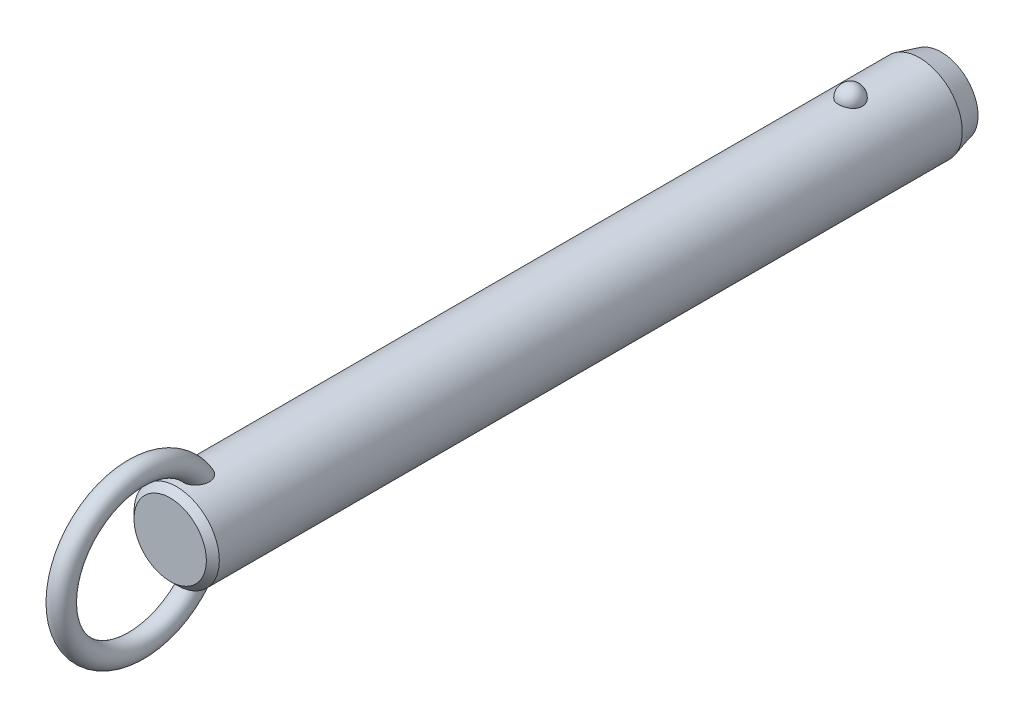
ISO-10303-21;
HEADER;
FILE_DESCRIPTION(('STEP AP214'),'2;1');
FILE_NAME('part.step','',(''),(''),'','','');
FILE_SCHEMA(('AUTOMOTIVE_DESIGN { 1 0 10303 214 1 1 1 1 }'));
ENDSEC;
DATA;
#1=APPLICATION_CONTEXT('core data for automotive mechanical design processes');
#2=APPLICATION_PROTOCOL_DEFINITION('international standard','automotive_design',2000,#1);
#3=PRODUCT_CONTEXT('',#1,'mechanical');
#4=PRODUCT('Part','Part','',(#3));
#5=PRODUCT_RELATED_PRODUCT_CATEGORY('part','',(#4));
#6=PRODUCT_DEFINITION_FORMATION('','',#4);
#7=PRODUCT_DEFINITION_CONTEXT('part definition',#1,'design');
#8=PRODUCT_DEFINITION('design','',#6,#7);
#9=PRODUCT_DEFINITION_SHAPE('','',#8);
#10=(LENGTH_UNIT() NAMED_UNIT(*) SI_UNIT(.MILLI.,.METRE.));
#11=(NAMED_UNIT(*) PLANE_ANGLE_UNIT() SI_UNIT($,.RADIAN.));
#12=(NAMED_UNIT(*) SI_UNIT($,.STERADIAN.) SOLID_ANGLE_UNIT());
#13=UNCERTAINTY_MEASURE_WITH_UNIT(LENGTH_MEASURE(1.E-05),#10,'distance_accuracy_value','');
#14=(GEOMETRIC_REPRESENTATION_CONTEXT(3) GLOBAL_UNCERTAINTY_ASSIGNED_CONTEXT((#13)) GLOBAL_UNIT_ASSIGNED_CONTEXT((#10,
#11,#12)) REPRESENTATION_CONTEXT('',''));
#15=CARTESIAN_POINT('',(0.,0.,0.));
#16=DIRECTION('',(0.,0.,1.));
#17=DIRECTION('',(1.,0.,0.));
#18=AXIS2_PLACEMENT_3D('',#15,#16,#17);
#19=CARTESIAN_POINT('',(0.,0.,114.3));
#20=DIRECTION('',(0.,0.,-1.));
#21=DIRECTION('',(-1.,0.,0.));
#22=AXIS2_PLACEMENT_3D('',#19,#20,#21);
#23=CYLINDRICAL_SURFACE('',#22,7.9);
#24=CARTESIAN_POINT('',(2.1785689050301,7.59367088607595,-2.19999999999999));
#25=CARTESIAN_POINT('',(2.17856679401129,7.59367269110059,-2.07701843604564));
#26=CARTESIAN_POINT('',(2.16853481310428,7.59657145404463,-1.95401006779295));
#27=CARTESIAN_POINT('',(2.12864689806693,7.607843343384,-1.71147811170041));
#28=CARTESIAN_POINT('',(2.09878338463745,7.61621856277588,-1.59195587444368));
#29=CARTESIAN_POINT('',(2.0199931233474,7.63749180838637,-1.3598563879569));
#30=CARTESIAN_POINT('',(1.97107475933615,7.6503878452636,-1.24727610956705));
#31=CARTESIAN_POINT('',(1.85539377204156,7.67926115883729,-1.03213234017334));
#32=CARTESIAN_POINT('',(1.78863158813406,7.69523835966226,-0.929568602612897));
#33=CARTESIAN_POINT('',(1.63856494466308,7.7285848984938,-0.736786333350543));
#34=CARTESIAN_POINT('',(1.55518140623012,7.7459606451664,-0.646630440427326));
#35=CARTESIAN_POINT('',(1.37422937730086,7.78009978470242,-0.481747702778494));
#36=CARTESIAN_POINT('',(1.27666086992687,7.79686317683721,-0.407020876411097));
#37=CARTESIAN_POINT('',(1.07024728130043,7.82786153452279,-0.275278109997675));
#38=CARTESIAN_POINT('',(0.961434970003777,7.84210353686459,-0.218212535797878));
#39=CARTESIAN_POINT('',(0.735351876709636,7.86652194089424,-0.123146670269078));
#40=CARTESIAN_POINT('',(0.618082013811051,7.87669878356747,-0.085144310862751));
#41=CARTESIAN_POINT('',(0.380637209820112,7.89170521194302,-0.0298158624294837));
#42=CARTESIAN_POINT('',(0.260550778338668,7.89662650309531,-0.0121347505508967));
#43=CARTESIAN_POINT('',(0.0190117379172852,7.90090003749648,0.00324379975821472));
#44=CARTESIAN_POINT('',(-0.102440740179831,7.90025280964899,0.00094313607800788));
#45=CARTESIAN_POINT('',(-0.341452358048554,7.89351056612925,-0.0233955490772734));
#46=CARTESIAN_POINT('',(-0.459042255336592,7.88749257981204,-0.0451545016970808));
#47=CARTESIAN_POINT('',(-0.688796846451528,7.87075812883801,-0.107408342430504));
#48=CARTESIAN_POINT('',(-0.800961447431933,7.86004158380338,-0.147903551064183));
#49=CARTESIAN_POINT('',(-1.01743634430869,7.83497131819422,-0.246799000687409));
#50=CARTESIAN_POINT('',(-1.12169791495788,7.82059709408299,-0.305300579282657));
#51=CARTESIAN_POINT('',(-1.31891765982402,7.78976470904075,-0.438549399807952));
#52=CARTESIAN_POINT('',(-1.41187469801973,7.77330633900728,-0.513298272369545));
#53=CARTESIAN_POINT('',(-1.58577142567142,7.73972434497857,-0.678622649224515));
#54=CARTESIAN_POINT('',(-1.66645140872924,7.72259402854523,-0.769470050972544));
#55=CARTESIAN_POINT('',(-1.81161503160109,7.68983776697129,-0.963538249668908));
#56=CARTESIAN_POINT('',(-1.87609753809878,7.6742119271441,-1.06675991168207));
#57=CARTESIAN_POINT('',(-1.98790138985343,7.6460202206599,-1.28401170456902));
#58=CARTESIAN_POINT('',(-2.03501994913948,7.63349104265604,-1.39815107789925));
#59=CARTESIAN_POINT('',(-2.10986724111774,7.6131449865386,-1.63301784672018));
#60=CARTESIAN_POINT('',(-2.1375965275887,7.60532797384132,-1.75374505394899));
#61=CARTESIAN_POINT('',(-2.17289256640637,7.5953195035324,-1.99782562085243));
#62=CARTESIAN_POINT('',(-2.18054294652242,7.59310471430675,-2.12116592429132));
#63=CARTESIAN_POINT('',(-2.17572919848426,7.59448538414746,-2.36741799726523));
#64=CARTESIAN_POINT('',(-2.1632656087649,7.59808068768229,-2.49032977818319));
#65=CARTESIAN_POINT('',(-2.11865035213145,7.61064035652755,-2.73161015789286));
#66=CARTESIAN_POINT('',(-2.08659579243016,7.61957823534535,-2.84999812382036));
#67=CARTESIAN_POINT('',(-2.00367799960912,7.64179982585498,-3.07955956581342));
#68=CARTESIAN_POINT('',(-1.9528140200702,7.65508371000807,-3.19073275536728));
#69=CARTESIAN_POINT('',(-1.83321113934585,7.68460381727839,-3.40337899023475));
#70=CARTESIAN_POINT('',(-1.76437735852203,7.70085556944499,-3.50479651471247));
#71=CARTESIAN_POINT('',(-1.61069526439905,7.73445734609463,-3.69446912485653));
#72=CARTESIAN_POINT('',(-1.52584634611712,7.75180741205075,-3.78272371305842));
#73=CARTESIAN_POINT('',(-1.34198059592,7.78574608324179,-3.94393987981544));
#74=CARTESIAN_POINT('',(-1.24291308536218,7.80233167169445,-4.01684434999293));
#75=CARTESIAN_POINT('',(-1.03352039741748,7.83281625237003,-4.14489386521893));
#76=CARTESIAN_POINT('',(-0.92319600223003,7.84671543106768,-4.20004014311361));
#77=CARTESIAN_POINT('',(-0.695822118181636,7.87011575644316,-4.29042017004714));
#78=CARTESIAN_POINT('',(-0.578872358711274,7.87966903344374,-4.32589112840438));
#79=CARTESIAN_POINT('',(-0.340410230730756,7.8935652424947,-4.37692226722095));
#80=CARTESIAN_POINT('',(-0.218898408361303,7.89790879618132,-4.39248482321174));
#81=CARTESIAN_POINT('',(0.0228107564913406,7.90087453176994,-4.40314405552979));
#82=CARTESIAN_POINT('',(0.142990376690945,7.89960185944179,-4.39861683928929));
#83=CARTESIAN_POINT('',(0.380829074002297,7.89171262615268,-4.37008293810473));
#84=CARTESIAN_POINT('',(0.498488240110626,7.8850962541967,-4.34607694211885));
#85=CARTESIAN_POINT('',(0.727535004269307,7.86726442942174,-4.27939317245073));
#86=CARTESIAN_POINT('',(0.838944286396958,7.85606616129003,-4.236785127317));
#87=CARTESIAN_POINT('',(1.05295421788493,7.83025654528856,-4.13408348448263));
#88=CARTESIAN_POINT('',(1.15555431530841,7.81564498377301,-4.07398879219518));
#89=CARTESIAN_POINT('',(1.35076763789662,7.7843022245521,-3.93687432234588));
#90=CARTESIAN_POINT('',(1.4432046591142,7.76754209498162,-3.85961036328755));
#91=CARTESIAN_POINT('',(1.6139111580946,7.73387857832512,-3.69076949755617));
#92=CARTESIAN_POINT('',(1.6921781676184,7.71697516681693,-3.59919010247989));
#93=CARTESIAN_POINT('',(1.83380875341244,7.6845643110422,-3.40247278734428));
#94=CARTESIAN_POINT('',(1.89689280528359,7.66908588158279,-3.29712873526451));
#95=CARTESIAN_POINT('',(2.0047823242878,7.64159441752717,-3.07707931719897));
#96=CARTESIAN_POINT('',(2.0495945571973,7.62958010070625,-2.96237743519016));
#97=CARTESIAN_POINT('',(2.11580183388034,7.61146617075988,-2.74040519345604));
#98=CARTESIAN_POINT('',(2.13929812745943,7.60484503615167,-2.63379846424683));
#99=CARTESIAN_POINT('',(2.17068242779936,7.59594664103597,-2.41813481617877));
#100=CARTESIAN_POINT('',(2.17857077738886,7.59366928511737,-2.30907795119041));
#101=CARTESIAN_POINT('',(2.1785689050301,7.59367088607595,-2.19999999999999));
#102=B_SPLINE_CURVE_WITH_KNOTS('',3,(#24,#25,#26,#27,#28,#29,#30,#31,#32,#33,#34,#35,#36,#37,
#38,#39,#40,#41,#42,#43,#44,#45,#46,#47,#48,#49,#50,#51,#52,#53,#54,#55,#56,#57,#58,#59,#60,#61,
#62,#63,#64,#65,#66,#67,#68,#69,#70,#71,#72,#73,#74,#75,#76,#77,#78,#79,#80,#81,#82,#83,#84,#85,
#86,#87,#88,#89,#90,#91,#92,#93,#94,#95,#96,#97,#98,#99,#100,#101),.UNSPECIFIED.,.T.,.F.,(4,2,2,
2,2,2,2,2,2,2,2,2,2,2,2,2,2,2,2,2,2,2,2,2,2,2,2,2,2,2,2,2,2,2,2,2,2,2,4),(0.,0.368552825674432,
0.737246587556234,1.10577831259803,1.4743009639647,1.8446206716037,2.21494081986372,
2.5842105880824,2.95344028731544,3.31611630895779,3.67875788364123,4.03628044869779,
4.39380913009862,4.75338791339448,5.11300280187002,5.47939989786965,5.8458226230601,
6.21639834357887,6.58696347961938,6.95598276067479,7.32499216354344,7.69218715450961,
8.0593967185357,8.42858578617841,8.79778880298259,9.16834203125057,9.5388695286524,
9.90482699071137,10.2707407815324,10.6298333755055,10.9889132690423,11.3466585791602,
11.7044262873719,12.0676511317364,12.4309391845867,12.8004764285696,13.1698767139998,
13.4967701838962,13.8236564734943),.UNSPECIFIED.);
#103=CARTESIAN_POINT('',(2.1785689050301,7.59367088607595,-2.19999999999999));
#104=VERTEX_POINT('',#103);
#105=EDGE_CURVE('E41',#104,#104,#102,.T.);
#106=ORIENTED_EDGE('',*,*,#105,.T.);
#107=EDGE_LOOP('',(#106));
#108=FACE_BOUND('',#107,.T.);
#109=CARTESIAN_POINT('',(0.,0.,122.62));
#110=DIRECTION('',(0.,0.,1.));
#111=DIRECTION('',(1.,0.,0.));
#112=AXIS2_PLACEMENT_3D('',#109,#110,#111);
#113=CIRCLE('',#112,7.9);
#114=CARTESIAN_POINT('',(7.9,0.,122.62));
#115=VERTEX_POINT('',#114);
#116=EDGE_CURVE('E10',#115,#115,#113,.F.);
#117=ORIENTED_EDGE('',*,*,#116,.T.);
#118=EDGE_LOOP('',(#117));
#119=FACE_BOUND('',#118,.T.);
#120=CARTESIAN_POINT('',(-0.630969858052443,-7.87476203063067,116.512432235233));
#121=CARTESIAN_POINT('',(-0.734180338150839,-7.8664899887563,116.547285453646));
#122=CARTESIAN_POINT('',(-0.834476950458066,-7.85639291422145,116.590816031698));
#123=CARTESIAN_POINT('',(-1.0262035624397,-7.83366343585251,116.694094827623));
#124=CARTESIAN_POINT('',(-1.1176141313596,-7.82102565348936,116.753877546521));
#125=CARTESIAN_POINT('',(-1.28877277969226,-7.79464922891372,116.887839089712));
#126=CARTESIAN_POINT('',(-1.36854014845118,-7.78091246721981,116.961993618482));
#127=CARTESIAN_POINT('',(-1.5146152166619,-7.75380398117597,117.122494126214));
#128=CARTESIAN_POINT('',(-1.58092966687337,-7.74043207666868,117.208833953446));
#129=CARTESIAN_POINT('',(-1.70019064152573,-7.71512522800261,117.392978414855));
#130=CARTESIAN_POINT('',(-1.75284037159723,-7.70322473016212,117.490979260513));
#131=CARTESIAN_POINT('',(-1.84263464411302,-7.68224112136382,117.694102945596));
#132=CARTESIAN_POINT('',(-1.87977299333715,-7.6731591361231,117.799228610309));
#133=CARTESIAN_POINT('',(-1.94152728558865,-7.65777930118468,118.023284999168));
#134=CARTESIAN_POINT('',(-1.96475471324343,-7.65179654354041,118.142616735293));
#135=CARTESIAN_POINT('',(-1.99449499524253,-7.64409642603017,118.38342986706));
#136=CARTESIAN_POINT('',(-2.0010005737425,-7.64238092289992,118.504912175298));
#137=CARTESIAN_POINT('',(-1.99856014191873,-7.64302120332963,118.768340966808));
#138=CARTESIAN_POINT('',(-1.98680021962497,-7.64611845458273,118.91025654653));
#139=CARTESIAN_POINT('',(-1.9445777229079,-7.65696186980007,119.191118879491));
#140=CARTESIAN_POINT('',(-1.91409393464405,-7.66471330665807,119.330062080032));
#141=CARTESIAN_POINT('',(-1.82768670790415,-7.68582947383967,119.631939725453));
#142=CARTESIAN_POINT('',(-1.76772963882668,-7.70003779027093,119.793686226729));
#143=CARTESIAN_POINT('',(-1.65998501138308,-7.72371550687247,120.027695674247));
#144=CARTESIAN_POINT('',(-1.62107967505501,-7.73200670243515,120.104297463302));
#145=CARTESIAN_POINT('',(-1.53727726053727,-7.74910377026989,120.254079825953));
#146=CARTESIAN_POINT('',(-1.49238215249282,-7.75790947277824,120.327261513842));
#147=CARTESIAN_POINT('',(-1.3739705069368,-7.77993338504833,120.50288382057));
#148=CARTESIAN_POINT('',(-1.29690364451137,-7.79328473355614,120.602955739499));
#149=CARTESIAN_POINT('',(-1.1288548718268,-7.81939266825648,120.790714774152));
#150=CARTESIAN_POINT('',(-1.03789926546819,-7.83215032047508,120.878424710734));
#151=CARTESIAN_POINT('',(-0.869532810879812,-7.85231710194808,121.013414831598));
#152=CARTESIAN_POINT('',(-0.795716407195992,-7.86021093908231,121.065076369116));
#153=CARTESIAN_POINT('',(-0.64081313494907,-7.87434920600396,121.156381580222));
#154=CARTESIAN_POINT('',(-0.559737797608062,-7.88059619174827,121.19604389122));
#155=CARTESIAN_POINT('',(-0.406456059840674,-7.88984116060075,121.254300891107));
#156=CARTESIAN_POINT('',(-0.335227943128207,-7.89321892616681,121.275384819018));
#157=CARTESIAN_POINT('',(-0.190193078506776,-7.89804235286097,121.30541418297));
#158=CARTESIAN_POINT('',(-0.116388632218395,-7.89948969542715,121.314370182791));
#159=CARTESIAN_POINT('',(0.031841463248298,-7.90028409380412,121.319291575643));
#160=CARTESIAN_POINT('',(0.106268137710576,-7.89962640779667,121.315227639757));
#161=CARTESIAN_POINT('',(0.253290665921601,-7.8962818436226,121.294461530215));
#162=CARTESIAN_POINT('',(0.325885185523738,-7.8935935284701,121.277750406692));
#163=CARTESIAN_POINT('',(0.4814417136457,-7.88577340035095,121.228738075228));
#164=CARTESIAN_POINT('',(0.563611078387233,-7.88026321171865,121.194005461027));
#165=CARTESIAN_POINT('',(0.721129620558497,-7.86741729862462,121.111796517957));
#166=CARTESIAN_POINT('',(0.79646633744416,-7.86007832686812,121.064297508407));
#167=CARTESIAN_POINT('',(0.971456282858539,-7.84073285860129,120.936513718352));
#168=CARTESIAN_POINT('',(1.06719686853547,-7.82809461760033,120.851004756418));
#169=CARTESIAN_POINT('',(1.24418921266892,-7.80192439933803,120.666232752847));
#170=CARTESIAN_POINT('',(1.32540832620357,-7.78839049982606,120.566939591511));
#171=CARTESIAN_POINT('',(1.45199971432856,-7.76559693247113,120.389576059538));
#172=CARTESIAN_POINT('',(1.50085649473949,-7.75626094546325,120.313954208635));
#173=CARTESIAN_POINT('',(1.59197749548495,-7.7380727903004,120.158742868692));
#174=CARTESIAN_POINT('',(1.63423919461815,-7.72922080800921,120.079151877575));
#175=CARTESIAN_POINT('',(1.7122261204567,-7.71231959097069,119.916664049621));
#176=CARTESIAN_POINT('',(1.74794516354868,-7.70427111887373,119.833764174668));
#177=CARTESIAN_POINT('',(1.81270113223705,-7.68929240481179,119.6652967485));
#178=CARTESIAN_POINT('',(1.84173789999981,-7.68236218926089,119.579729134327));
#179=CARTESIAN_POINT('',(1.89322698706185,-7.6698375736,119.40528702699));
#180=CARTESIAN_POINT('',(1.91558744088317,-7.66426199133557,119.316383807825));
#181=CARTESIAN_POINT('',(1.9528136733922,-7.65485915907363,119.136969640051));
#182=CARTESIAN_POINT('',(1.96767946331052,-7.65103190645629,119.046458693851));
#183=CARTESIAN_POINT('',(2.00021456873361,-7.64262981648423,118.773732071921));
#184=CARTESIAN_POINT('',(2.00600691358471,-7.6410871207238,118.589709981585));
#185=CARTESIAN_POINT('',(1.98445334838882,-7.64669564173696,118.276501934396));
#186=CARTESIAN_POINT('',(1.96607186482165,-7.65149688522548,118.146618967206));
#187=CARTESIAN_POINT('',(1.90884967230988,-7.6659762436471,117.891632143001));
#188=CARTESIAN_POINT('',(1.87002101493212,-7.67565148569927,117.766525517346));
#189=CARTESIAN_POINT('',(1.77063986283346,-7.69918471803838,117.52454013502));
#190=CARTESIAN_POINT('',(1.70993724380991,-7.71307150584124,117.407725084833));
#191=CARTESIAN_POINT('',(1.56733070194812,-7.74330306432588,117.188144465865));
#192=CARTESIAN_POINT('',(1.48543692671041,-7.75964665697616,117.085372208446));
#193=CARTESIAN_POINT('',(1.31346177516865,-7.79047523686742,116.909380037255));
#194=CARTESIAN_POINT('',(1.22547278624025,-7.80495298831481,116.834106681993));
#195=CARTESIAN_POINT('',(1.03724352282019,-7.83218597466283,116.700486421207));
#196=CARTESIAN_POINT('',(0.937008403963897,-7.84494192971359,116.642132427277));
#197=CARTESIAN_POINT('',(0.733599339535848,-7.86649045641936,116.547027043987));
#198=CARTESIAN_POINT('',(0.630941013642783,-7.87547134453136,116.509210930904));
#199=CARTESIAN_POINT('',(0.420465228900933,-7.88950708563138,116.451116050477));
#200=CARTESIAN_POINT('',(0.312645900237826,-7.89456050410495,116.43084369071));
#201=CARTESIAN_POINT('',(0.0960869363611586,-7.9001518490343,116.408455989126));
#202=CARTESIAN_POINT('',(-0.0126341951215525,-7.90073226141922,116.406169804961));
#203=CARTESIAN_POINT('',(-0.228766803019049,-7.89742350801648,116.419367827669));
#204=CARTESIAN_POINT('',(-0.33618060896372,-7.89354403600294,116.434813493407));
#205=CARTESIAN_POINT('',(-0.473410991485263,-7.88586871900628,116.466217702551));
#206=CARTESIAN_POINT('',(-0.505257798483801,-7.88388984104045,116.474354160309));
#207=CARTESIAN_POINT('',(-0.568481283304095,-7.87958326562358,116.492208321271));
#208=CARTESIAN_POINT('',(-0.599857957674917,-7.87725556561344,116.501926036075));
#209=CARTESIAN_POINT('',(-0.630969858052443,-7.87476203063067,116.512432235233));
#210=B_SPLINE_CURVE_WITH_KNOTS('',3,(#120,#121,#122,#123,#124,#125,#126,#127,#128,#129,#130,
#131,#132,#133,#134,#135,#136,#137,#138,#139,#140,#141,#142,#143,#144,#145,#146,#147,#148,#149,
#150,#151,#152,#153,#154,#155,#156,#157,#158,#159,#160,#161,#162,#163,#164,#165,#166,#167,#168,
#169,#170,#171,#172,#173,#174,#175,#176,#177,#178,#179,#180,#181,#182,#183,#184,#185,#186,#187,
#188,#189,#190,#191,#192,#193,#194,#195,#196,#197,#198,#199,#200,#201,#202,#203,#204,#205,#206,
#207,#208,#209),.UNSPECIFIED.,.T.,.F.,(4,2,2,2,2,2,2,2,2,2,2,2,2,2,2,2,2,2,2,2,2,2,2,2,2,2,2,2,
2,2,2,2,2,2,2,2,2,2,2,2,2,2,2,2,4),(0.,0.327622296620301,0.655945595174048,0.983718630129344,
1.3113267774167,1.64554655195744,1.9798996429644,2.34365728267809,2.70757317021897,
3.13333684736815,3.55958380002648,4.07655306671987,4.33527897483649,4.59391999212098,
4.9738243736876,5.35301797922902,5.62348245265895,5.89352465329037,6.11565959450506,
6.3376009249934,6.56004255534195,6.782641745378,7.04930844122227,7.31645206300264,
7.70130871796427,8.08701995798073,8.35824509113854,8.62957365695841,8.90115735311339,
9.17274746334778,9.44791855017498,9.72308922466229,10.2715298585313,10.6638393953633,
11.0559179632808,11.4507403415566,11.845374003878,12.1936425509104,12.5417649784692,
12.8695063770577,13.1973674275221,13.5221104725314,13.8461490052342,13.9449071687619,
14.0436660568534),.UNSPECIFIED.);
#211=CARTESIAN_POINT('',(-0.630969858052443,-7.87476203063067,116.512432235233));
#212=VERTEX_POINT('',#211);
#213=EDGE_CURVE('E59',#212,#212,#210,.T.);
#214=ORIENTED_EDGE('',*,*,#213,.T.);
#215=EDGE_LOOP('',(#214));
#216=FACE_BOUND('',#215,.T.);
#217=CARTESIAN_POINT('',(-0.630969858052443,7.87476203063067,116.512432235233));
#218=CARTESIAN_POINT('',(-0.52891882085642,7.88293636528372,116.477979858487));
#219=CARTESIAN_POINT('',(-0.423745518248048,7.8893481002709,116.451915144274));
#220=CARTESIAN_POINT('',(-0.210236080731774,7.8979273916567,116.417282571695));
#221=CARTESIAN_POINT('',(-0.101893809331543,7.90008607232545,116.408751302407));
#222=CARTESIAN_POINT('',(0.114660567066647,7.89990877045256,116.409457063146));
#223=CARTESIAN_POINT('',(0.222872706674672,7.89757640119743,116.41867980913));
#224=CARTESIAN_POINT('',(0.436107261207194,7.88867538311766,116.454652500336));
#225=CARTESIAN_POINT('',(0.541131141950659,7.8821087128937,116.48139425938));
#226=CARTESIAN_POINT('',(0.745085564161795,7.86545130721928,116.551756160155));
#227=CARTESIAN_POINT('',(0.844015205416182,7.85536005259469,116.595378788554));
#228=CARTESIAN_POINT('',(1.03299167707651,7.83275153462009,116.698379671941));
#229=CARTESIAN_POINT('',(1.12303841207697,7.8202342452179,116.757758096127));
#230=CARTESIAN_POINT('',(1.29214734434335,7.79408219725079,116.890864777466));
#231=CARTESIAN_POINT('',(1.37116907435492,7.78044359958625,116.964643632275));
#232=CARTESIAN_POINT('',(1.51597677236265,7.75353170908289,117.124235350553));
#233=CARTESIAN_POINT('',(1.58176261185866,7.74025841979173,117.210048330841));
#234=CARTESIAN_POINT('',(1.70057386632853,7.71504069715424,117.393644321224));
#235=CARTESIAN_POINT('',(1.75320073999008,7.70314257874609,117.491690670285));
#236=CARTESIAN_POINT('',(1.84293767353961,7.68216822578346,117.694893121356));
#237=CARTESIAN_POINT('',(1.88004278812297,7.67309289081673,117.800051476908));
#238=CARTESIAN_POINT('',(1.9417232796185,7.6577294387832,118.024167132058));
#239=CARTESIAN_POINT('',(1.96491037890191,7.65175648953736,118.143524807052));
#240=CARTESIAN_POINT('',(1.9945689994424,7.64407702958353,118.384384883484));
#241=CARTESIAN_POINT('',(2.00103304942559,7.64237242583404,118.50588821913));
#242=CARTESIAN_POINT('',(1.99850166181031,7.64303650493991,118.769368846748));
#243=CARTESIAN_POINT('',(1.98669038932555,7.64614714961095,118.911314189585));
#244=CARTESIAN_POINT('',(1.94436120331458,7.6570170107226,119.192228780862));
#245=CARTESIAN_POINT('',(1.91382203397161,7.66478150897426,119.331194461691));
#246=CARTESIAN_POINT('',(1.82728754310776,7.68592483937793,119.633111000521));
#247=CARTESIAN_POINT('',(1.76725778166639,7.7001468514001,119.794872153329));
#248=CARTESIAN_POINT('',(1.65939700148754,7.72384204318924,120.028891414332));
#249=CARTESIAN_POINT('',(1.62045187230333,7.73213852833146,120.105494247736));
#250=CARTESIAN_POINT('',(1.5365668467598,7.74924489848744,120.255273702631));
#251=CARTESIAN_POINT('',(1.49162892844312,7.75805461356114,120.328451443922));
#252=CARTESIAN_POINT('',(1.37317698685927,7.78007342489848,120.503952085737));
#253=CARTESIAN_POINT('',(1.29612360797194,7.79341423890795,120.603911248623));
#254=CARTESIAN_POINT('',(1.12812043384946,7.81949839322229,120.79145083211));
#255=CARTESIAN_POINT('',(1.03719688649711,7.83224280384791,120.879054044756));
#256=CARTESIAN_POINT('',(0.86887194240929,7.85239026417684,121.01389715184));
#257=CARTESIAN_POINT('',(0.795056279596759,7.86027769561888,121.065511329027));
#258=CARTESIAN_POINT('',(0.640160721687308,7.87440222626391,121.156720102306));
#259=CARTESIAN_POINT('',(0.559092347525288,7.88064188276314,121.196333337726));
#260=CARTESIAN_POINT('',(0.40582092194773,7.8898738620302,121.254505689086));
#261=CARTESIAN_POINT('',(0.334594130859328,7.89324577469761,121.275552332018));
#262=CARTESIAN_POINT('',(0.189568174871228,7.89805733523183,121.305507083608));
#263=CARTESIAN_POINT('',(0.115771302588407,7.89949866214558,121.314425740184));
#264=CARTESIAN_POINT('',(-0.0324359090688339,7.90028156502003,121.31927589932));
#265=CARTESIAN_POINT('',(-0.106847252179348,7.89961843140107,121.315178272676));
#266=CARTESIAN_POINT('',(-0.253834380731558,7.8962642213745,121.294351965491));
#267=CARTESIAN_POINT('',(-0.326408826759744,7.89357170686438,121.277614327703));
#268=CARTESIAN_POINT('',(-0.48196226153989,7.88574179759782,121.228539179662));
#269=CARTESIAN_POINT('',(-0.564145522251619,7.88022507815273,121.193763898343));
#270=CARTESIAN_POINT('',(-0.72168526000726,7.8673664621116,121.111468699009));
#271=CARTESIAN_POINT('',(-0.797029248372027,7.8600213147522,121.063926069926));
#272=CARTESIAN_POINT('',(-0.972044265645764,7.84066026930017,120.936026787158));
#273=CARTESIAN_POINT('',(-1.06779803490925,7.82801274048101,120.850443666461));
#274=CARTESIAN_POINT('',(-1.24480531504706,7.80182621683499,120.665522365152));
#275=CARTESIAN_POINT('',(-1.32602618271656,7.78828530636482,120.566154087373));
#276=CARTESIAN_POINT('',(-1.45259834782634,7.76548487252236,120.388680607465));
#277=CARTESIAN_POINT('',(-1.50143856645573,7.75614818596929,120.313025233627));
#278=CARTESIAN_POINT('',(-1.59252410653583,7.7379602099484,120.157748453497));
#279=CARTESIAN_POINT('',(-1.63476690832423,7.72910910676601,120.078125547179));
#280=CARTESIAN_POINT('',(-1.71271318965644,7.71221133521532,119.915575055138));
#281=CARTESIAN_POINT('',(-1.74841047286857,7.70416543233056,119.832644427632));
#282=CARTESIAN_POINT('',(-1.81311929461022,7.68919371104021,119.664116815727));
#283=CARTESIAN_POINT('',(-1.84213067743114,7.6822679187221,119.578519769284));
#284=CARTESIAN_POINT('',(-1.89356259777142,7.66975461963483,119.404025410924));
#285=CARTESIAN_POINT('',(-1.91589165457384,7.66418586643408,119.315099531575));
#286=CARTESIAN_POINT('',(-1.95305070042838,7.65479859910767,119.135642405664));
#287=CARTESIAN_POINT('',(-1.96788069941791,7.65098008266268,119.045111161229));
#288=CARTESIAN_POINT('',(-2.00030078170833,7.64260704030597,118.772327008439));
#289=CARTESIAN_POINT('',(-2.00600576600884,7.64108760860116,118.588271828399));
#290=CARTESIAN_POINT('',(-1.98428483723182,7.64673945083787,118.275080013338));
#291=CARTESIAN_POINT('',(-1.96583698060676,7.6515575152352,118.145240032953));
#292=CARTESIAN_POINT('',(-1.9084894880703,7.66606613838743,117.890361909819));
#293=CARTESIAN_POINT('',(-1.86960376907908,7.67575338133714,117.765320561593));
#294=CARTESIAN_POINT('',(-1.77013421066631,7.69930132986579,117.523500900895));
#295=CARTESIAN_POINT('',(-1.7094048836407,7.71318991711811,117.406784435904));
#296=CARTESIAN_POINT('',(-1.56672953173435,7.74342495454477,117.187340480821));
#297=CARTESIAN_POINT('',(-1.48478316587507,7.75977144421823,117.08461321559));
#298=CARTESIAN_POINT('',(-1.31266325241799,7.79061163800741,116.908643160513));
#299=CARTESIAN_POINT('',(-1.22456383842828,7.80509908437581,116.833358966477));
#300=CARTESIAN_POINT('',(-1.03622400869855,7.83231881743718,116.699865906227));
#301=CARTESIAN_POINT('',(-0.936015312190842,7.84505551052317,116.641613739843));
#302=CARTESIAN_POINT('',(-0.798824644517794,7.85957802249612,116.577540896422));
#303=CARTESIAN_POINT('',(-0.765787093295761,7.8628682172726,116.563224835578));
#304=CARTESIAN_POINT('',(-0.698939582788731,7.86909211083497,116.536436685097));
#305=CARTESIAN_POINT('',(-0.665129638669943,7.8720258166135,116.523964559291));
#306=CARTESIAN_POINT('',(-0.630969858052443,7.87476203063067,116.512432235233));
#307=B_SPLINE_CURVE_WITH_KNOTS('',3,(#217,#218,#219,#220,#221,#222,#223,#224,#225,#226,#227,
#228,#229,#230,#231,#232,#233,#234,#235,#236,#237,#238,#239,#240,#241,#242,#243,#244,#245,#246,
#247,#248,#249,#250,#251,#252,#253,#254,#255,#256,#257,#258,#259,#260,#261,#262,#263,#264,#265,
#266,#267,#268,#269,#270,#271,#272,#273,#274,#275,#276,#277,#278,#279,#280,#281,#282,#283,#284,
#285,#286,#287,#288,#289,#290,#291,#292,#293,#294,#295,#296,#297,#298,#299,#300,#301,#302,#303,
#304,#305,#306),.UNSPECIFIED.,.T.,.F.,(4,2,2,2,2,2,2,2,2,2,2,2,2,2,2,2,2,2,2,2,2,2,2,2,2,2,2,2,
2,2,2,2,2,2,2,2,2,2,2,2,2,2,2,2,4),(0.,0.32392037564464,0.648516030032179,0.97285063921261,
1.29703380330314,1.62126473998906,1.94549915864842,2.27089401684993,2.5962920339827,
2.93059633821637,3.26500707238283,3.6288164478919,3.99278833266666,4.41865421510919,
4.84500434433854,5.36209210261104,5.62087589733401,5.87957448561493,6.2591859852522,
6.63808782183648,6.9084674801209,7.17842501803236,7.40052350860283,7.62242871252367,
7.84483086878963,8.06739077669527,8.33414615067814,8.60137921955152,8.98641454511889,
9.37230415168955,9.64358673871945,9.9149726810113,10.1866142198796,10.458262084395,
10.7334745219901,11.0086865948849,11.5572126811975,11.9494246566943,12.3413699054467,
12.7359755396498,13.1305875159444,13.4791770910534,13.82687259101,13.9353013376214,
14.0437279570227),.UNSPECIFIED.);
#308=CARTESIAN_POINT('',(-0.630969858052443,7.87476203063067,116.512432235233));
#309=VERTEX_POINT('',#308);
#310=EDGE_CURVE('E66',#309,#309,#307,.T.);
#311=ORIENTED_EDGE('',*,*,#310,.T.);
#312=EDGE_LOOP('',(#311));
#313=FACE_BOUND('',#312,.T.);
#314=CARTESIAN_POINT('',(0.,0.,-15.));
#315=DIRECTION('',(0.,0.,-1.));
#316=DIRECTION('',(-1.,0.,0.));
#317=AXIS2_PLACEMENT_3D('',#314,#315,#316);
#318=CIRCLE('',#317,7.9);
#319=CARTESIAN_POINT('',(-7.9,0.,-15.));
#320=VERTEX_POINT('',#319);
#321=EDGE_CURVE('E56',#320,#320,#318,.F.);
#322=ORIENTED_EDGE('',*,*,#321,.T.);
#323=EDGE_LOOP('',(#322));
#324=FACE_BOUND('',#323,.T.);
#325=ADVANCED_FACE('F37',(#108,#119,#216,#313,#324),#23,.T.);
#326=CARTESIAN_POINT('',(0.,0.,-19.));
#327=DIRECTION('',(0.,0.,-1.));
#328=DIRECTION('',(-1.,0.,0.));
#329=AXIS2_PLACEMENT_3D('',#326,#327,#328);
#330=PLANE('',#329);
#331=CARTESIAN_POINT('',(0.,0.,-19.));
#332=DIRECTION('',(0.,0.,-1.));
#333=DIRECTION('',(-1.,0.,0.));
#334=AXIS2_PLACEMENT_3D('',#331,#332,#333);
#335=CIRCLE('',#334,6.82820323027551);
#336=CARTESIAN_POINT('',(-6.82820323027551,0.,-19.));
#337=VERTEX_POINT('',#336);
#338=EDGE_CURVE('E65',#337,#337,#335,.T.);
#339=ORIENTED_EDGE('',*,*,#338,.T.);
#340=EDGE_LOOP('',(#339));
#341=FACE_BOUND('',#340,.T.);
#342=ADVANCED_FACE('F84',(#341),#330,.T.);
#343=CARTESIAN_POINT('',(0.,0.,-19.));
#344=DIRECTION('',(0.,0.,1.));
#345=DIRECTION('',(1.,0.,0.));
#346=AXIS2_PLACEMENT_3D('',#343,#344,#345);
#347=CONICAL_SURFACE('',#346,6.82820323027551,0.261799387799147);
#348=ORIENTED_EDGE('',*,*,#321,.F.);
#349=EDGE_LOOP('',(#348));
#350=FACE_BOUND('',#349,.T.);
#351=ORIENTED_EDGE('',*,*,#338,.F.);
#352=EDGE_LOOP('',(#351));
#353=FACE_BOUND('',#352,.T.);
#354=ADVANCED_FACE('F82',(#350,#353),#347,.T.);
#355=CARTESIAN_POINT('',(0.,0.,123.82));
#356=DIRECTION('',(0.,0.,1.));
#357=DIRECTION('',(1.,0.,0.));
#358=AXIS2_PLACEMENT_3D('',#355,#356,#357);
#359=PLANE('',#358);
#360=CARTESIAN_POINT('',(0.,0.,123.82));
#361=DIRECTION('',(0.,0.,1.));
#362=DIRECTION('',(1.,0.,0.));
#363=AXIS2_PLACEMENT_3D('',#360,#361,#362);
#364=CIRCLE('',#363,6.70000000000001);
#365=CARTESIAN_POINT('',(6.70000000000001,0.,123.82));
#366=VERTEX_POINT('',#365);
#367=EDGE_CURVE('E50',#366,#366,#364,.T.);
#368=ORIENTED_EDGE('',*,*,#367,.T.);
#369=EDGE_LOOP('',(#368));
#370=FACE_BOUND('',#369,.T.);
#371=ADVANCED_FACE('F76',(#370),#359,.T.);
#372=CARTESIAN_POINT('',(0.,0.,130.15));
#373=DIRECTION('',(1.,0.,0.));
#374=DIRECTION('',(0.,0.,-1.));
#375=AXIS2_PLACEMENT_3D('',#372,#373,#374);
#376=TOROIDAL_SURFACE('',#375,13.85,2.);
#377=ORIENTED_EDGE('',*,*,#310,.F.);
#378=EDGE_LOOP('',(#377));
#379=FACE_BOUND('',#378,.T.);
#380=ORIENTED_EDGE('',*,*,#213,.F.);
#381=EDGE_LOOP('',(#380));
#382=FACE_BOUND('',#381,.T.);
#383=ADVANCED_FACE('F72',(#379,#382),#376,.T.);
#384=CARTESIAN_POINT('',(0.,0.,123.82));
#385=DIRECTION('',(0.,0.,-1.));
#386=DIRECTION('',(-1.,0.,0.));
#387=AXIS2_PLACEMENT_3D('',#384,#385,#386);
#388=CONICAL_SURFACE('',#387,6.70000000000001,0.785398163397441);
#389=ORIENTED_EDGE('',*,*,#116,.F.);
#390=EDGE_LOOP('',(#389));
#391=FACE_BOUND('',#390,.T.);
#392=ORIENTED_EDGE('',*,*,#367,.F.);
#393=EDGE_LOOP('',(#392));
#394=FACE_BOUND('',#393,.T.);
#395=ADVANCED_FACE('F39',(#391,#394),#388,.T.);
#396=CARTESIAN_POINT('',(0.,7.9,-2.19999999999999));
#397=DIRECTION('',(0.,1.,0.));
#398=DIRECTION('',(0.,0.,-1.));
#399=AXIS2_PLACEMENT_3D('',#396,#397,#398);
#400=SPHERICAL_SURFACE('',#399,2.2);
#401=ORIENTED_EDGE('',*,*,#105,.F.);
#402=EDGE_LOOP('',(#401));
#403=FACE_BOUND('',#402,.T.);
#404=ADVANCED_FACE('F78',(#403),#400,.T.);
#405=CLOSED_SHELL('',(#325,#342,#354,#371,#383,#395,#404));
#406=MANIFOLD_SOLID_BREP('B2',#405);
#407=ADVANCED_BREP_SHAPE_REPRESENTATION('',(#18,#406),#14);
#408=SHAPE_DEFINITION_REPRESENTATION(#9,#407);
ENDSEC;
END-ISO-10303-21;
